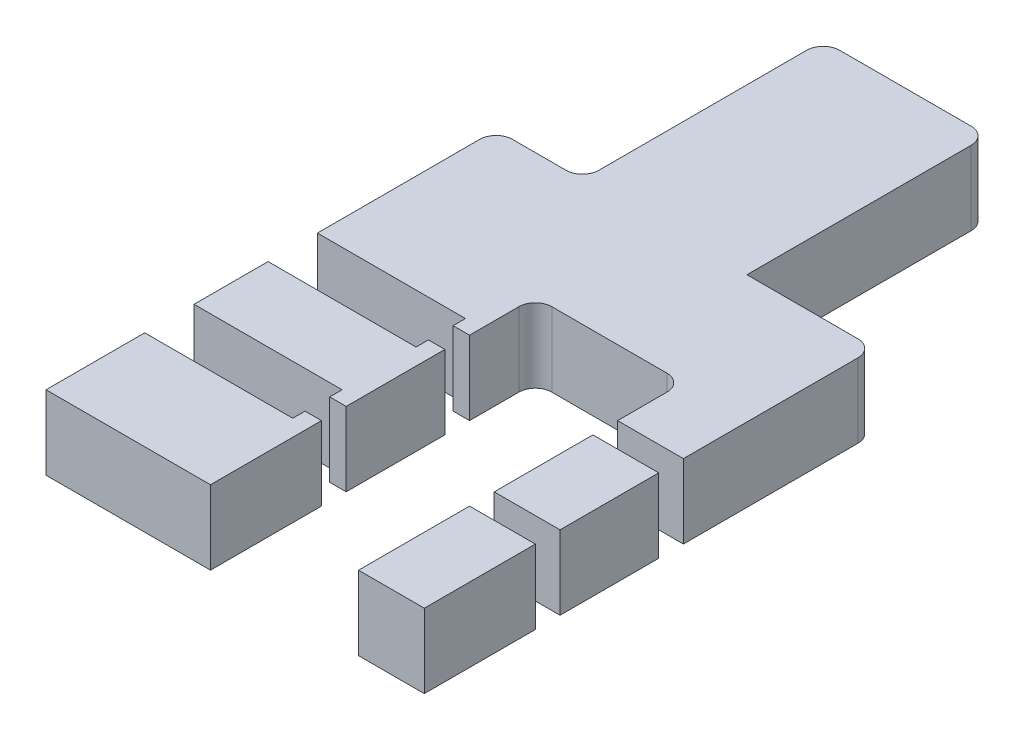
ISO-10303-21;
HEADER;
FILE_DESCRIPTION(('STEP AP214'),'2;1');
FILE_NAME('part.step','',(''),(''),'','','');
FILE_SCHEMA(('AUTOMOTIVE_DESIGN { 1 0 10303 214 1 1 1 1 }'));
ENDSEC;
DATA;
#1=APPLICATION_CONTEXT('core data for automotive mechanical design processes');
#2=APPLICATION_PROTOCOL_DEFINITION('international standard','automotive_design',2000,#1);
#3=PRODUCT_CONTEXT('',#1,'mechanical');
#4=PRODUCT('Part','Part','',(#3));
#5=PRODUCT_RELATED_PRODUCT_CATEGORY('part','',(#4));
#6=PRODUCT_DEFINITION_FORMATION('','',#4);
#7=PRODUCT_DEFINITION_CONTEXT('part definition',#1,'design');
#8=PRODUCT_DEFINITION('design','',#6,#7);
#9=PRODUCT_DEFINITION_SHAPE('','',#8);
#10=(LENGTH_UNIT() NAMED_UNIT(*) SI_UNIT(.MILLI.,.METRE.));
#11=(NAMED_UNIT(*) PLANE_ANGLE_UNIT() SI_UNIT($,.RADIAN.));
#12=(NAMED_UNIT(*) SI_UNIT($,.STERADIAN.) SOLID_ANGLE_UNIT());
#13=UNCERTAINTY_MEASURE_WITH_UNIT(LENGTH_MEASURE(1.E-05),#10,'distance_accuracy_value','');
#14=(GEOMETRIC_REPRESENTATION_CONTEXT(3) GLOBAL_UNCERTAINTY_ASSIGNED_CONTEXT((#13)) GLOBAL_UNIT_ASSIGNED_CONTEXT((#10,
#11,#12)) REPRESENTATION_CONTEXT('',''));
#15=CARTESIAN_POINT('',(0.,0.,0.));
#16=DIRECTION('',(0.,0.,1.));
#17=DIRECTION('',(1.,0.,0.));
#18=AXIS2_PLACEMENT_3D('',#15,#16,#17);
#19=CARTESIAN_POINT('',(17.,9.,39.5));
#20=DIRECTION('',(-1.,0.,0.));
#21=DIRECTION('',(0.,0.,1.));
#22=AXIS2_PLACEMENT_3D('',#19,#20,#21);
#23=PLANE('',#22);
#24=DIRECTION('',(0.,0.,-1.));
#25=VECTOR('',#24,1.);
#26=CARTESIAN_POINT('',(17.,0.,39.5));
#27=LINE('',#26,#25);
#28=CARTESIAN_POINT('',(17.,0.,39.5));
#29=VERTEX_POINT('',#28);
#30=CARTESIAN_POINT('',(17.,0.,26.));
#31=VERTEX_POINT('',#30);
#32=EDGE_CURVE('E47',#29,#31,#27,.T.);
#33=ORIENTED_EDGE('',*,*,#32,.T.);
#34=DIRECTION('',(0.,1.,0.));
#35=VECTOR('',#34,1.);
#36=CARTESIAN_POINT('',(17.,9.,26.));
#37=LINE('',#36,#35);
#38=CARTESIAN_POINT('',(17.,9.,26.));
#39=VERTEX_POINT('',#38);
#40=EDGE_CURVE('E61',#31,#39,#37,.T.);
#41=ORIENTED_EDGE('',*,*,#40,.T.);
#42=DIRECTION('',(0.,0.,-1.));
#43=VECTOR('',#42,1.);
#44=CARTESIAN_POINT('',(17.,9.,39.5));
#45=LINE('',#44,#43);
#46=CARTESIAN_POINT('',(17.,9.,39.5));
#47=VERTEX_POINT('',#46);
#48=EDGE_CURVE('E98',#47,#39,#45,.T.);
#49=ORIENTED_EDGE('',*,*,#48,.F.);
#50=DIRECTION('',(0.,-1.,0.));
#51=VECTOR('',#50,1.);
#52=CARTESIAN_POINT('',(17.,9.,39.5));
#53=LINE('',#52,#51);
#54=EDGE_CURVE('E93',#47,#29,#53,.T.);
#55=ORIENTED_EDGE('',*,*,#54,.T.);
#56=EDGE_LOOP('',(#33,#41,#49,#55));
#57=FACE_BOUND('',#56,.T.);
#58=ADVANCED_FACE('F44',(#57),#23,.F.);
#59=CARTESIAN_POINT('',(9.,9.,0.));
#60=DIRECTION('',(1.,0.,0.));
#61=DIRECTION('',(0.,0.,-1.));
#62=AXIS2_PLACEMENT_3D('',#59,#60,#61);
#63=PLANE('',#62);
#64=DIRECTION('',(0.,0.,1.));
#65=VECTOR('',#64,1.);
#66=CARTESIAN_POINT('',(9.,9.,0.));
#67=LINE('',#66,#65);
#68=CARTESIAN_POINT('',(9.00000000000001,9.,26.));
#69=VERTEX_POINT('',#68);
#70=CARTESIAN_POINT('',(9.00000000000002,9.,39.5));
#71=VERTEX_POINT('',#70);
#72=EDGE_CURVE('E92',#69,#71,#67,.T.);
#73=ORIENTED_EDGE('',*,*,#72,.F.);
#74=DIRECTION('',(0.,-1.,0.));
#75=VECTOR('',#74,1.);
#76=CARTESIAN_POINT('',(9.00000000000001,9.,26.));
#77=LINE('',#76,#75);
#78=CARTESIAN_POINT('',(9.00000000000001,0.,26.));
#79=VERTEX_POINT('',#78);
#80=EDGE_CURVE('E79',#69,#79,#77,.T.);
#81=ORIENTED_EDGE('',*,*,#80,.T.);
#82=DIRECTION('',(0.,0.,1.));
#83=VECTOR('',#82,1.);
#84=CARTESIAN_POINT('',(9.,0.,0.));
#85=LINE('',#84,#83);
#86=CARTESIAN_POINT('',(9.00000000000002,0.,39.5));
#87=VERTEX_POINT('',#86);
#88=EDGE_CURVE('E90',#79,#87,#85,.T.);
#89=ORIENTED_EDGE('',*,*,#88,.T.);
#90=DIRECTION('',(0.,-1.,0.));
#91=VECTOR('',#90,1.);
#92=CARTESIAN_POINT('',(9.00000000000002,9.,39.5));
#93=LINE('',#92,#91);
#94=EDGE_CURVE('E53',#71,#87,#93,.T.);
#95=ORIENTED_EDGE('',*,*,#94,.F.);
#96=EDGE_LOOP('',(#73,#81,#89,#95));
#97=FACE_BOUND('',#96,.T.);
#98=ADVANCED_FACE('F88',(#97),#63,.F.);
#99=CARTESIAN_POINT('',(0.,9.,0.));
#100=DIRECTION('',(0.,-1.,0.));
#101=DIRECTION('',(0.,0.,-1.));
#102=AXIS2_PLACEMENT_3D('',#99,#100,#101);
#103=PLANE('',#102);
#104=ORIENTED_EDGE('',*,*,#48,.T.);
#105=DIRECTION('',(-1.,0.,0.));
#106=VECTOR('',#105,1.);
#107=CARTESIAN_POINT('',(0.,9.,26.));
#108=LINE('',#107,#106);
#109=EDGE_CURVE('E100',#39,#69,#108,.T.);
#110=ORIENTED_EDGE('',*,*,#109,.T.);
#111=ORIENTED_EDGE('',*,*,#72,.T.);
#112=DIRECTION('',(1.,0.,0.));
#113=VECTOR('',#112,1.);
#114=CARTESIAN_POINT('',(9.00000000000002,9.,39.5));
#115=LINE('',#114,#113);
#116=EDGE_CURVE('E104',#71,#47,#115,.T.);
#117=ORIENTED_EDGE('',*,*,#116,.T.);
#118=EDGE_LOOP('',(#104,#110,#111,#117));
#119=FACE_BOUND('',#118,.T.);
#120=ADVANCED_FACE('F114',(#119),#103,.F.);
#121=CARTESIAN_POINT('',(0.,0.,0.));
#122=DIRECTION('',(0.,-1.,0.));
#123=DIRECTION('',(0.,0.,-1.));
#124=AXIS2_PLACEMENT_3D('',#121,#122,#123);
#125=PLANE('',#124);
#126=DIRECTION('',(-1.,0.,0.));
#127=VECTOR('',#126,1.);
#128=CARTESIAN_POINT('',(0.,0.,26.));
#129=LINE('',#128,#127);
#130=EDGE_CURVE('E12',#31,#79,#129,.T.);
#131=ORIENTED_EDGE('',*,*,#130,.F.);
#132=ORIENTED_EDGE('',*,*,#32,.F.);
#133=DIRECTION('',(1.,0.,0.));
#134=VECTOR('',#133,1.);
#135=CARTESIAN_POINT('',(9.00000000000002,0.,39.5));
#136=LINE('',#135,#134);
#137=EDGE_CURVE('E97',#87,#29,#136,.T.);
#138=ORIENTED_EDGE('',*,*,#137,.F.);
#139=ORIENTED_EDGE('',*,*,#88,.F.);
#140=EDGE_LOOP('',(#131,#132,#138,#139));
#141=FACE_BOUND('',#140,.T.);
#142=ADVANCED_FACE('F96',(#141),#125,.T.);
#143=CARTESIAN_POINT('',(9.00000000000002,9.,39.5));
#144=DIRECTION('',(0.,0.,-1.));
#145=DIRECTION('',(-1.,0.,0.));
#146=AXIS2_PLACEMENT_3D('',#143,#144,#145);
#147=PLANE('',#146);
#148=ORIENTED_EDGE('',*,*,#137,.T.);
#149=ORIENTED_EDGE('',*,*,#54,.F.);
#150=ORIENTED_EDGE('',*,*,#116,.F.);
#151=ORIENTED_EDGE('',*,*,#94,.T.);
#152=EDGE_LOOP('',(#148,#149,#150,#151));
#153=FACE_BOUND('',#152,.T.);
#154=ADVANCED_FACE('F117',(#153),#147,.F.);
#155=CARTESIAN_POINT('',(-50.4890898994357,0.,26.));
#156=DIRECTION('',(0.,0.,1.));
#157=DIRECTION('',(1.,0.,0.));
#158=AXIS2_PLACEMENT_3D('',#155,#156,#157);
#159=PLANE('',#158);
#160=ORIENTED_EDGE('',*,*,#130,.T.);
#161=ORIENTED_EDGE('',*,*,#80,.F.);
#162=ORIENTED_EDGE('',*,*,#109,.F.);
#163=ORIENTED_EDGE('',*,*,#40,.F.);
#164=EDGE_LOOP('',(#160,#161,#162,#163));
#165=FACE_BOUND('',#164,.T.);
#166=ADVANCED_FACE('F81',(#165),#159,.F.);
#167=CLOSED_SHELL('',(#58,#98,#120,#142,#154,#166));
#168=MANIFOLD_SOLID_BREP('B2',#167);
#169=CARTESIAN_POINT('',(0.,9.,0.));
#170=DIRECTION('',(0.,-1.,0.));
#171=DIRECTION('',(0.,0.,-1.));
#172=AXIS2_PLACEMENT_3D('',#169,#170,#171);
#173=PLANE('',#172);
#174=DIRECTION('',(-1.,0.,0.));
#175=VECTOR('',#174,1.);
#176=CARTESIAN_POINT('',(0.,9.,26.));
#177=LINE('',#176,#175);
#178=CARTESIAN_POINT('',(-8.99999999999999,9.,26.));
#179=VERTEX_POINT('',#178);
#180=CARTESIAN_POINT('',(-11.,9.,26.));
#181=VERTEX_POINT('',#180);
#182=EDGE_CURVE('E263',#179,#181,#177,.T.);
#183=ORIENTED_EDGE('',*,*,#182,.T.);
#184=DIRECTION('',(0.,0.,-1.));
#185=VECTOR('',#184,1.);
#186=CARTESIAN_POINT('',(-11.,9.,21.5));
#187=LINE('',#186,#185);
#188=CARTESIAN_POINT('',(-11.,9.,27.5));
#189=VERTEX_POINT('',#188);
#190=EDGE_CURVE('E192',#189,#181,#187,.T.);
#191=ORIENTED_EDGE('',*,*,#190,.F.);
#192=DIRECTION('',(1.,0.,0.));
#193=VECTOR('',#192,1.);
#194=CARTESIAN_POINT('',(-29.,9.,27.5));
#195=LINE('',#194,#193);
#196=CARTESIAN_POINT('',(-29.,9.,27.5));
#197=VERTEX_POINT('',#196);
#198=EDGE_CURVE('E276',#197,#189,#195,.T.);
#199=ORIENTED_EDGE('',*,*,#198,.F.);
#200=DIRECTION('',(0.,0.,1.));
#201=VECTOR('',#200,1.);
#202=CARTESIAN_POINT('',(-29.,9.,39.5));
#203=LINE('',#202,#201);
#204=CARTESIAN_POINT('',(-29.,9.,39.5));
#205=VERTEX_POINT('',#204);
#206=EDGE_CURVE('E247',#197,#205,#203,.T.);
#207=ORIENTED_EDGE('',*,*,#206,.T.);
#208=DIRECTION('',(1.,0.,0.));
#209=VECTOR('',#208,1.);
#210=CARTESIAN_POINT('',(-8.99999999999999,9.,39.5));
#211=LINE('',#210,#209);
#212=CARTESIAN_POINT('',(-8.99999999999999,9.,39.5));
#213=VERTEX_POINT('',#212);
#214=EDGE_CURVE('E262',#205,#213,#211,.T.);
#215=ORIENTED_EDGE('',*,*,#214,.T.);
#216=DIRECTION('',(0.,0.,-1.));
#217=VECTOR('',#216,1.);
#218=CARTESIAN_POINT('',(-9.,9.,0.));
#219=LINE('',#218,#217);
#220=EDGE_CURVE('E264',#213,#179,#219,.T.);
#221=ORIENTED_EDGE('',*,*,#220,.T.);
#222=EDGE_LOOP('',(#183,#191,#199,#207,#215,#221));
#223=FACE_BOUND('',#222,.T.);
#224=ADVANCED_FACE('F178',(#223),#173,.F.);
#225=CARTESIAN_POINT('',(0.,0.,0.));
#226=DIRECTION('',(0.,-1.,0.));
#227=DIRECTION('',(0.,0.,-1.));
#228=AXIS2_PLACEMENT_3D('',#225,#226,#227);
#229=PLANE('',#228);
#230=DIRECTION('',(0.,0.,-1.));
#231=VECTOR('',#230,1.);
#232=CARTESIAN_POINT('',(-11.,0.,21.5));
#233=LINE('',#232,#231);
#234=CARTESIAN_POINT('',(-11.,0.,27.5));
#235=VERTEX_POINT('',#234);
#236=CARTESIAN_POINT('',(-11.,0.,26.));
#237=VERTEX_POINT('',#236);
#238=EDGE_CURVE('E239',#235,#237,#233,.T.);
#239=ORIENTED_EDGE('',*,*,#238,.T.);
#240=DIRECTION('',(1.,0.,0.));
#241=VECTOR('',#240,1.);
#242=CARTESIAN_POINT('',(-50.4890898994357,0.,26.));
#243=LINE('',#242,#241);
#244=CARTESIAN_POINT('',(-9.,0.,26.));
#245=VERTEX_POINT('',#244);
#246=EDGE_CURVE('E199',#237,#245,#243,.T.);
#247=ORIENTED_EDGE('',*,*,#246,.T.);
#248=DIRECTION('',(0.,0.,-1.));
#249=VECTOR('',#248,1.);
#250=CARTESIAN_POINT('',(-9.,0.,0.));
#251=LINE('',#250,#249);
#252=CARTESIAN_POINT('',(-8.99999999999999,0.,39.5));
#253=VERTEX_POINT('',#252);
#254=EDGE_CURVE('E258',#253,#245,#251,.T.);
#255=ORIENTED_EDGE('',*,*,#254,.F.);
#256=DIRECTION('',(1.,0.,0.));
#257=VECTOR('',#256,1.);
#258=CARTESIAN_POINT('',(-8.99999999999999,0.,39.5));
#259=LINE('',#258,#257);
#260=CARTESIAN_POINT('',(-29.,0.,39.5));
#261=VERTEX_POINT('',#260);
#262=EDGE_CURVE('E251',#261,#253,#259,.T.);
#263=ORIENTED_EDGE('',*,*,#262,.F.);
#264=DIRECTION('',(0.,0.,1.));
#265=VECTOR('',#264,1.);
#266=CARTESIAN_POINT('',(-29.,0.,39.5));
#267=LINE('',#266,#265);
#268=CARTESIAN_POINT('',(-29.,0.,27.5));
#269=VERTEX_POINT('',#268);
#270=EDGE_CURVE('E245',#269,#261,#267,.T.);
#271=ORIENTED_EDGE('',*,*,#270,.F.);
#272=DIRECTION('',(1.,0.,0.));
#273=VECTOR('',#272,1.);
#274=CARTESIAN_POINT('',(-29.,0.,27.5));
#275=LINE('',#274,#273);
#276=EDGE_CURVE('E230',#269,#235,#275,.T.);
#277=ORIENTED_EDGE('',*,*,#276,.T.);
#278=EDGE_LOOP('',(#239,#247,#255,#263,#271,#277));
#279=FACE_BOUND('',#278,.T.);
#280=ADVANCED_FACE('F250',(#279),#229,.T.);
#281=CARTESIAN_POINT('',(-9.,9.,0.));
#282=DIRECTION('',(-1.,0.,0.));
#283=DIRECTION('',(0.,0.,1.));
#284=AXIS2_PLACEMENT_3D('',#281,#282,#283);
#285=PLANE('',#284);
#286=ORIENTED_EDGE('',*,*,#254,.T.);
#287=DIRECTION('',(0.,1.,0.));
#288=VECTOR('',#287,1.);
#289=CARTESIAN_POINT('',(-9.,9.,26.));
#290=LINE('',#289,#288);
#291=EDGE_CURVE('E255',#245,#179,#290,.T.);
#292=ORIENTED_EDGE('',*,*,#291,.T.);
#293=ORIENTED_EDGE('',*,*,#220,.F.);
#294=DIRECTION('',(0.,-1.,0.));
#295=VECTOR('',#294,1.);
#296=CARTESIAN_POINT('',(-8.99999999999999,9.,39.5));
#297=LINE('',#296,#295);
#298=EDGE_CURVE('E252',#213,#253,#297,.T.);
#299=ORIENTED_EDGE('',*,*,#298,.T.);
#300=EDGE_LOOP('',(#286,#292,#293,#299));
#301=FACE_BOUND('',#300,.T.);
#302=ADVANCED_FACE('F282',(#301),#285,.F.);
#303=CARTESIAN_POINT('',(-29.,9.,39.5));
#304=DIRECTION('',(1.,0.,0.));
#305=DIRECTION('',(0.,0.,-1.));
#306=AXIS2_PLACEMENT_3D('',#303,#304,#305);
#307=PLANE('',#306);
#308=ORIENTED_EDGE('',*,*,#206,.F.);
#309=DIRECTION('',(0.,1.,0.));
#310=VECTOR('',#309,1.);
#311=CARTESIAN_POINT('',(-29.,0.,27.5));
#312=LINE('',#311,#310);
#313=EDGE_CURVE('E234',#269,#197,#312,.T.);
#314=ORIENTED_EDGE('',*,*,#313,.F.);
#315=ORIENTED_EDGE('',*,*,#270,.T.);
#316=DIRECTION('',(0.,-1.,0.));
#317=VECTOR('',#316,1.);
#318=CARTESIAN_POINT('',(-29.,9.,39.5));
#319=LINE('',#318,#317);
#320=EDGE_CURVE('E185',#205,#261,#319,.T.);
#321=ORIENTED_EDGE('',*,*,#320,.F.);
#322=EDGE_LOOP('',(#308,#314,#315,#321));
#323=FACE_BOUND('',#322,.T.);
#324=ADVANCED_FACE('F243',(#323),#307,.F.);
#325=CARTESIAN_POINT('',(-8.99999999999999,9.,39.5));
#326=DIRECTION('',(0.,0.,-1.));
#327=DIRECTION('',(-1.,0.,0.));
#328=AXIS2_PLACEMENT_3D('',#325,#326,#327);
#329=PLANE('',#328);
#330=ORIENTED_EDGE('',*,*,#262,.T.);
#331=ORIENTED_EDGE('',*,*,#298,.F.);
#332=ORIENTED_EDGE('',*,*,#214,.F.);
#333=ORIENTED_EDGE('',*,*,#320,.T.);
#334=EDGE_LOOP('',(#330,#331,#332,#333));
#335=FACE_BOUND('',#334,.T.);
#336=ADVANCED_FACE('F286',(#335),#329,.F.);
#337=CARTESIAN_POINT('',(-50.4890898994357,0.,26.));
#338=DIRECTION('',(0.,0.,1.));
#339=DIRECTION('',(1.,0.,0.));
#340=AXIS2_PLACEMENT_3D('',#337,#338,#339);
#341=PLANE('',#340);
#342=ORIENTED_EDGE('',*,*,#246,.F.);
#343=DIRECTION('',(0.,1.,0.));
#344=VECTOR('',#343,1.);
#345=CARTESIAN_POINT('',(-11.,0.,26.));
#346=LINE('',#345,#344);
#347=EDGE_CURVE('E42',#237,#181,#346,.T.);
#348=ORIENTED_EDGE('',*,*,#347,.T.);
#349=ORIENTED_EDGE('',*,*,#182,.F.);
#350=ORIENTED_EDGE('',*,*,#291,.F.);
#351=EDGE_LOOP('',(#342,#348,#349,#350));
#352=FACE_BOUND('',#351,.T.);
#353=ADVANCED_FACE('F279',(#352),#341,.F.);
#354=CARTESIAN_POINT('',(-11.,0.,21.5));
#355=DIRECTION('',(1.,0.,0.));
#356=DIRECTION('',(0.,0.,-1.));
#357=AXIS2_PLACEMENT_3D('',#354,#355,#356);
#358=PLANE('',#357);
#359=ORIENTED_EDGE('',*,*,#238,.F.);
#360=DIRECTION('',(0.,1.,0.));
#361=VECTOR('',#360,1.);
#362=CARTESIAN_POINT('',(-11.,0.,27.5));
#363=LINE('',#362,#361);
#364=EDGE_CURVE('E236',#235,#189,#363,.T.);
#365=ORIENTED_EDGE('',*,*,#364,.T.);
#366=ORIENTED_EDGE('',*,*,#190,.T.);
#367=ORIENTED_EDGE('',*,*,#347,.F.);
#368=EDGE_LOOP('',(#359,#365,#366,#367));
#369=FACE_BOUND('',#368,.T.);
#370=ADVANCED_FACE('F301',(#369),#358,.F.);
#371=CARTESIAN_POINT('',(-29.,0.,27.5));
#372=DIRECTION('',(0.,0.,1.));
#373=DIRECTION('',(1.,0.,0.));
#374=AXIS2_PLACEMENT_3D('',#371,#372,#373);
#375=PLANE('',#374);
#376=ORIENTED_EDGE('',*,*,#198,.T.);
#377=ORIENTED_EDGE('',*,*,#364,.F.);
#378=ORIENTED_EDGE('',*,*,#276,.F.);
#379=ORIENTED_EDGE('',*,*,#313,.T.);
#380=EDGE_LOOP('',(#376,#377,#378,#379));
#381=FACE_BOUND('',#380,.T.);
#382=ADVANCED_FACE('F233',(#381),#375,.F.);
#383=CLOSED_SHELL('',(#224,#280,#302,#324,#336,#353,#370,#382));
#384=MANIFOLD_SOLID_BREP('B6',#383);
#385=CARTESIAN_POINT('',(-47.5605721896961,0.,11.));
#386=DIRECTION('',(0.,0.,1.));
#387=DIRECTION('',(1.,0.,0.));
#388=AXIS2_PLACEMENT_3D('',#385,#386,#387);
#389=PLANE('',#388);
#390=DIRECTION('',(-1.,0.,0.));
#391=VECTOR('',#390,1.);
#392=CARTESIAN_POINT('',(0.,0.,11.));
#393=LINE('',#392,#391);
#394=CARTESIAN_POINT('',(17.,0.,11.));
#395=VERTEX_POINT('',#394);
#396=CARTESIAN_POINT('',(9.00000000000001,0.,11.));
#397=VERTEX_POINT('',#396);
#398=EDGE_CURVE('E372',#395,#397,#393,.T.);
#399=ORIENTED_EDGE('',*,*,#398,.T.);
#400=DIRECTION('',(0.,-1.,0.));
#401=VECTOR('',#400,1.);
#402=CARTESIAN_POINT('',(9.00000000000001,9.,11.));
#403=LINE('',#402,#401);
#404=CARTESIAN_POINT('',(9.00000000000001,9.,11.));
#405=VERTEX_POINT('',#404);
#406=EDGE_CURVE('E419',#405,#397,#403,.T.);
#407=ORIENTED_EDGE('',*,*,#406,.F.);
#408=DIRECTION('',(-1.,0.,0.));
#409=VECTOR('',#408,1.);
#410=CARTESIAN_POINT('',(0.,9.,11.));
#411=LINE('',#410,#409);
#412=CARTESIAN_POINT('',(17.,9.,11.));
#413=VERTEX_POINT('',#412);
#414=EDGE_CURVE('E423',#413,#405,#411,.T.);
#415=ORIENTED_EDGE('',*,*,#414,.F.);
#416=DIRECTION('',(0.,1.,0.));
#417=VECTOR('',#416,1.);
#418=CARTESIAN_POINT('',(17.,9.,11.));
#419=LINE('',#418,#417);
#420=EDGE_CURVE('E417',#395,#413,#419,.T.);
#421=ORIENTED_EDGE('',*,*,#420,.F.);
#422=EDGE_LOOP('',(#399,#407,#415,#421));
#423=FACE_BOUND('',#422,.T.);
#424=ADVANCED_FACE('F364',(#423),#389,.F.);
#425=CARTESIAN_POINT('',(0.,9.,0.));
#426=DIRECTION('',(0.,-1.,0.));
#427=DIRECTION('',(0.,0.,-1.));
#428=AXIS2_PLACEMENT_3D('',#425,#426,#427);
#429=PLANE('',#428);
#430=DIRECTION('',(0.,0.,1.));
#431=VECTOR('',#430,1.);
#432=CARTESIAN_POINT('',(9.,9.,0.));
#433=LINE('',#432,#431);
#434=CARTESIAN_POINT('',(9.00000000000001,9.,23.));
#435=VERTEX_POINT('',#434);
#436=EDGE_CURVE('E427',#405,#435,#433,.T.);
#437=ORIENTED_EDGE('',*,*,#436,.T.);
#438=DIRECTION('',(1.,0.,0.));
#439=VECTOR('',#438,1.);
#440=CARTESIAN_POINT('',(0.,9.,23.));
#441=LINE('',#440,#439);
#442=CARTESIAN_POINT('',(17.,9.,23.));
#443=VERTEX_POINT('',#442);
#444=EDGE_CURVE('E407',#435,#443,#441,.T.);
#445=ORIENTED_EDGE('',*,*,#444,.T.);
#446=DIRECTION('',(0.,0.,-1.));
#447=VECTOR('',#446,1.);
#448=CARTESIAN_POINT('',(17.,9.,39.5));
#449=LINE('',#448,#447);
#450=EDGE_CURVE('E414',#443,#413,#449,.T.);
#451=ORIENTED_EDGE('',*,*,#450,.T.);
#452=ORIENTED_EDGE('',*,*,#414,.T.);
#453=EDGE_LOOP('',(#437,#445,#451,#452));
#454=FACE_BOUND('',#453,.T.);
#455=ADVANCED_FACE('F433',(#454),#429,.F.);
#456=CARTESIAN_POINT('',(0.,0.,0.));
#457=DIRECTION('',(0.,-1.,0.));
#458=DIRECTION('',(0.,0.,-1.));
#459=AXIS2_PLACEMENT_3D('',#456,#457,#458);
#460=PLANE('',#459);
#461=DIRECTION('',(1.,0.,0.));
#462=VECTOR('',#461,1.);
#463=CARTESIAN_POINT('',(0.,0.,23.));
#464=LINE('',#463,#462);
#465=CARTESIAN_POINT('',(9.00000000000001,0.,23.));
#466=VERTEX_POINT('',#465);
#467=CARTESIAN_POINT('',(17.,0.,23.));
#468=VERTEX_POINT('',#467);
#469=EDGE_CURVE('E176',#466,#468,#464,.T.);
#470=ORIENTED_EDGE('',*,*,#469,.F.);
#471=DIRECTION('',(0.,0.,1.));
#472=VECTOR('',#471,1.);
#473=CARTESIAN_POINT('',(9.,0.,0.));
#474=LINE('',#473,#472);
#475=EDGE_CURVE('E425',#397,#466,#474,.T.);
#476=ORIENTED_EDGE('',*,*,#475,.F.);
#477=ORIENTED_EDGE('',*,*,#398,.F.);
#478=DIRECTION('',(0.,0.,-1.));
#479=VECTOR('',#478,1.);
#480=CARTESIAN_POINT('',(17.,0.,39.5));
#481=LINE('',#480,#479);
#482=EDGE_CURVE('E387',#468,#395,#481,.T.);
#483=ORIENTED_EDGE('',*,*,#482,.F.);
#484=EDGE_LOOP('',(#470,#476,#477,#483));
#485=FACE_BOUND('',#484,.T.);
#486=ADVANCED_FACE('F416',(#485),#460,.T.);
#487=CARTESIAN_POINT('',(9.,9.,0.));
#488=DIRECTION('',(1.,0.,0.));
#489=DIRECTION('',(0.,0.,-1.));
#490=AXIS2_PLACEMENT_3D('',#487,#488,#489);
#491=PLANE('',#490);
#492=ORIENTED_EDGE('',*,*,#475,.T.);
#493=DIRECTION('',(0.,1.,0.));
#494=VECTOR('',#493,1.);
#495=CARTESIAN_POINT('',(9.00000000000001,9.,23.));
#496=LINE('',#495,#494);
#497=EDGE_CURVE('E378',#466,#435,#496,.T.);
#498=ORIENTED_EDGE('',*,*,#497,.T.);
#499=ORIENTED_EDGE('',*,*,#436,.F.);
#500=ORIENTED_EDGE('',*,*,#406,.T.);
#501=EDGE_LOOP('',(#492,#498,#499,#500));
#502=FACE_BOUND('',#501,.T.);
#503=ADVANCED_FACE('F435',(#502),#491,.F.);
#504=CARTESIAN_POINT('',(17.,9.,39.5));
#505=DIRECTION('',(-1.,0.,0.));
#506=DIRECTION('',(0.,0.,1.));
#507=AXIS2_PLACEMENT_3D('',#504,#505,#506);
#508=PLANE('',#507);
#509=ORIENTED_EDGE('',*,*,#450,.F.);
#510=DIRECTION('',(0.,-1.,0.));
#511=VECTOR('',#510,1.);
#512=CARTESIAN_POINT('',(17.,9.,23.));
#513=LINE('',#512,#511);
#514=EDGE_CURVE('E404',#443,#468,#513,.T.);
#515=ORIENTED_EDGE('',*,*,#514,.T.);
#516=ORIENTED_EDGE('',*,*,#482,.T.);
#517=ORIENTED_EDGE('',*,*,#420,.T.);
#518=EDGE_LOOP('',(#509,#515,#516,#517));
#519=FACE_BOUND('',#518,.T.);
#520=ADVANCED_FACE('F366',(#519),#508,.F.);
#521=CARTESIAN_POINT('',(-50.4890898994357,0.,23.));
#522=DIRECTION('',(0.,0.,-1.));
#523=DIRECTION('',(-1.,0.,0.));
#524=AXIS2_PLACEMENT_3D('',#521,#522,#523);
#525=PLANE('',#524);
#526=ORIENTED_EDGE('',*,*,#444,.F.);
#527=ORIENTED_EDGE('',*,*,#497,.F.);
#528=ORIENTED_EDGE('',*,*,#469,.T.);
#529=ORIENTED_EDGE('',*,*,#514,.F.);
#530=EDGE_LOOP('',(#526,#527,#528,#529));
#531=FACE_BOUND('',#530,.T.);
#532=ADVANCED_FACE('F409',(#531),#525,.F.);
#533=CLOSED_SHELL('',(#424,#455,#486,#503,#520,#532));
#534=MANIFOLD_SOLID_BREP('B36',#533);
#535=CARTESIAN_POINT('',(-7.,9.,2.));
#536=DIRECTION('',(0.,1.,0.));
#537=DIRECTION('',(0.,0.,1.));
#538=AXIS2_PLACEMENT_3D('',#535,#536,#537);
#539=CYLINDRICAL_SURFACE('',#538,2.);
#540=CARTESIAN_POINT('',(-7.,9.,2.));
#541=DIRECTION('',(0.,-1.,0.));
#542=DIRECTION('',(0.,0.,-1.));
#543=AXIS2_PLACEMENT_3D('',#540,#541,#542);
#544=CIRCLE('',#543,2.);
#545=CARTESIAN_POINT('',(-9.,9.,2.));
#546=VERTEX_POINT('',#545);
#547=CARTESIAN_POINT('',(-7.,9.,0.));
#548=VERTEX_POINT('',#547);
#549=EDGE_CURVE('E676',#546,#548,#544,.T.);
#550=ORIENTED_EDGE('',*,*,#549,.F.);
#551=DIRECTION('',(0.,-1.,0.));
#552=VECTOR('',#551,1.);
#553=CARTESIAN_POINT('',(-9.,9.,2.));
#554=LINE('',#553,#552);
#555=CARTESIAN_POINT('',(-9.,0.,2.));
#556=VERTEX_POINT('',#555);
#557=EDGE_CURVE('E716',#556,#546,#554,.F.);
#558=ORIENTED_EDGE('',*,*,#557,.F.);
#559=CARTESIAN_POINT('',(-7.,0.,2.));
#560=DIRECTION('',(0.,-1.,0.));
#561=DIRECTION('',(0.,0.,-1.));
#562=AXIS2_PLACEMENT_3D('',#559,#560,#561);
#563=CIRCLE('',#562,2.);
#564=CARTESIAN_POINT('',(-7.,0.,0.));
#565=VERTEX_POINT('',#564);
#566=EDGE_CURVE('E745',#565,#556,#563,.F.);
#567=ORIENTED_EDGE('',*,*,#566,.F.);
#568=DIRECTION('',(0.,-1.,0.));
#569=VECTOR('',#568,1.);
#570=CARTESIAN_POINT('',(-7.,0.,0.));
#571=LINE('',#570,#569);
#572=EDGE_CURVE('E839',#548,#565,#571,.T.);
#573=ORIENTED_EDGE('',*,*,#572,.F.);
#574=EDGE_LOOP('',(#550,#558,#567,#573));
#575=FACE_BOUND('',#574,.T.);
#576=ADVANCED_FACE('F497',(#575),#539,.F.);
#577=CARTESIAN_POINT('',(-9.,9.,0.));
#578=DIRECTION('',(0.,0.,-1.));
#579=DIRECTION('',(-1.,0.,0.));
#580=AXIS2_PLACEMENT_3D('',#577,#578,#579);
#581=PLANE('',#580);
#582=DIRECTION('',(1.,0.,0.));
#583=VECTOR('',#582,1.);
#584=CARTESIAN_POINT('',(-9.,0.,0.));
#585=LINE('',#584,#583);
#586=CARTESIAN_POINT('',(7.,0.,0.));
#587=VERTEX_POINT('',#586);
#588=EDGE_CURVE('E746',#565,#587,#585,.T.);
#589=ORIENTED_EDGE('',*,*,#588,.T.);
#590=DIRECTION('',(0.,-1.,0.));
#591=VECTOR('',#590,1.);
#592=CARTESIAN_POINT('',(7.,9.,0.));
#593=LINE('',#592,#591);
#594=CARTESIAN_POINT('',(7.,9.,0.));
#595=VERTEX_POINT('',#594);
#596=EDGE_CURVE('E749',#587,#595,#593,.F.);
#597=ORIENTED_EDGE('',*,*,#596,.T.);
#598=DIRECTION('',(1.,0.,0.));
#599=VECTOR('',#598,1.);
#600=CARTESIAN_POINT('',(-9.,9.,0.));
#601=LINE('',#600,#599);
#602=EDGE_CURVE('E673',#548,#595,#601,.T.);
#603=ORIENTED_EDGE('',*,*,#602,.F.);
#604=ORIENTED_EDGE('',*,*,#572,.T.);
#605=EDGE_LOOP('',(#589,#597,#603,#604));
#606=FACE_BOUND('',#605,.T.);
#607=ADVANCED_FACE('F790',(#606),#581,.F.);
#608=CARTESIAN_POINT('',(7.,9.,2.));
#609=DIRECTION('',(0.,1.,0.));
#610=DIRECTION('',(0.,0.,1.));
#611=AXIS2_PLACEMENT_3D('',#608,#609,#610);
#612=CYLINDRICAL_SURFACE('',#611,2.);
#613=CARTESIAN_POINT('',(7.,9.,2.));
#614=DIRECTION('',(0.,-1.,0.));
#615=DIRECTION('',(0.,0.,-1.));
#616=AXIS2_PLACEMENT_3D('',#613,#614,#615);
#617=CIRCLE('',#616,2.);
#618=CARTESIAN_POINT('',(9.,9.,2.));
#619=VERTEX_POINT('',#618);
#620=EDGE_CURVE('E672',#595,#619,#617,.T.);
#621=ORIENTED_EDGE('',*,*,#620,.F.);
#622=ORIENTED_EDGE('',*,*,#596,.F.);
#623=CARTESIAN_POINT('',(7.,0.,2.));
#624=DIRECTION('',(0.,-1.,0.));
#625=DIRECTION('',(0.,0.,-1.));
#626=AXIS2_PLACEMENT_3D('',#623,#624,#625);
#627=CIRCLE('',#626,2.);
#628=CARTESIAN_POINT('',(9.,0.,2.));
#629=VERTEX_POINT('',#628);
#630=EDGE_CURVE('E736',#629,#587,#627,.F.);
#631=ORIENTED_EDGE('',*,*,#630,.F.);
#632=DIRECTION('',(0.,-1.,0.));
#633=VECTOR('',#632,1.);
#634=CARTESIAN_POINT('',(9.,0.,2.));
#635=LINE('',#634,#633);
#636=EDGE_CURVE('E699',#619,#629,#635,.T.);
#637=ORIENTED_EDGE('',*,*,#636,.F.);
#638=EDGE_LOOP('',(#621,#622,#631,#637));
#639=FACE_BOUND('',#638,.T.);
#640=ADVANCED_FACE('F796',(#639),#612,.F.);
#641=CARTESIAN_POINT('',(15.,9.,-13.2275954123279));
#642=DIRECTION('',(0.,-1.,0.));
#643=DIRECTION('',(0.,0.,-1.));
#644=AXIS2_PLACEMENT_3D('',#641,#642,#643);
#645=CYLINDRICAL_SURFACE('',#644,2.);
#646=CARTESIAN_POINT('',(15.,9.,-13.2275954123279));
#647=DIRECTION('',(0.,-1.,0.));
#648=DIRECTION('',(0.,0.,-1.));
#649=AXIS2_PLACEMENT_3D('',#646,#647,#648);
#650=CIRCLE('',#649,2.);
#651=CARTESIAN_POINT('',(17.,9.,-13.2275954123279));
#652=VERTEX_POINT('',#651);
#653=CARTESIAN_POINT('',(15.,9.,-15.2275954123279));
#654=VERTEX_POINT('',#653);
#655=EDGE_CURVE('E694',#652,#654,#650,.F.);
#656=ORIENTED_EDGE('',*,*,#655,.F.);
#657=DIRECTION('',(0.,-1.,0.));
#658=VECTOR('',#657,1.);
#659=CARTESIAN_POINT('',(17.,9.,-13.2275954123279));
#660=LINE('',#659,#658);
#661=CARTESIAN_POINT('',(17.,0.,-13.2275954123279));
#662=VERTEX_POINT('',#661);
#663=EDGE_CURVE('E720',#662,#652,#660,.F.);
#664=ORIENTED_EDGE('',*,*,#663,.F.);
#665=CARTESIAN_POINT('',(15.,0.,-13.2275954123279));
#666=DIRECTION('',(0.,-1.,0.));
#667=DIRECTION('',(0.,0.,-1.));
#668=AXIS2_PLACEMENT_3D('',#665,#666,#667);
#669=CIRCLE('',#668,2.);
#670=CARTESIAN_POINT('',(15.,0.,-15.2275954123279));
#671=VERTEX_POINT('',#670);
#672=EDGE_CURVE('E731',#671,#662,#669,.T.);
#673=ORIENTED_EDGE('',*,*,#672,.F.);
#674=DIRECTION('',(0.,-1.,0.));
#675=VECTOR('',#674,1.);
#676=CARTESIAN_POINT('',(15.,9.,-15.2275954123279));
#677=LINE('',#676,#675);
#678=EDGE_CURVE('E643',#654,#671,#677,.T.);
#679=ORIENTED_EDGE('',*,*,#678,.F.);
#680=EDGE_LOOP('',(#656,#664,#673,#679));
#681=FACE_BOUND('',#680,.T.);
#682=ADVANCED_FACE('F806',(#681),#645,.T.);
#683=CARTESIAN_POINT('',(1.5,9.,-15.2275954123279));
#684=DIRECTION('',(0.,0.,1.));
#685=DIRECTION('',(1.,0.,0.));
#686=AXIS2_PLACEMENT_3D('',#683,#684,#685);
#687=PLANE('',#686);
#688=DIRECTION('',(-1.,0.,0.));
#689=VECTOR('',#688,1.);
#690=CARTESIAN_POINT('',(1.5,9.,-15.2275954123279));
#691=LINE('',#690,#689);
#692=CARTESIAN_POINT('',(1.5,9.,-15.2275954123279));
#693=VERTEX_POINT('',#692);
#694=EDGE_CURVE('E691',#654,#693,#691,.T.);
#695=ORIENTED_EDGE('',*,*,#694,.F.);
#696=ORIENTED_EDGE('',*,*,#678,.T.);
#697=DIRECTION('',(-1.,0.,0.));
#698=VECTOR('',#697,1.);
#699=CARTESIAN_POINT('',(1.5,0.,-15.2275954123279));
#700=LINE('',#699,#698);
#701=CARTESIAN_POINT('',(1.5,0.,-15.2275954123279));
#702=VERTEX_POINT('',#701);
#703=EDGE_CURVE('E636',#671,#702,#700,.T.);
#704=ORIENTED_EDGE('',*,*,#703,.T.);
#705=DIRECTION('',(0.,-1.,0.));
#706=VECTOR('',#705,1.);
#707=CARTESIAN_POINT('',(1.5,9.,-15.2275954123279));
#708=LINE('',#707,#706);
#709=EDGE_CURVE('E640',#693,#702,#708,.T.);
#710=ORIENTED_EDGE('',*,*,#709,.F.);
#711=EDGE_LOOP('',(#695,#696,#704,#710));
#712=FACE_BOUND('',#711,.T.);
#713=ADVANCED_FACE('F639',(#712),#687,.F.);
#714=CARTESIAN_POINT('',(1.49999999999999,9.,-44.5));
#715=DIRECTION('',(-1.,0.,0.));
#716=DIRECTION('',(0.,0.,1.));
#717=AXIS2_PLACEMENT_3D('',#714,#715,#716);
#718=PLANE('',#717);
#719=DIRECTION('',(0.,0.,-1.));
#720=VECTOR('',#719,1.);
#721=CARTESIAN_POINT('',(1.49999999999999,0.,-44.5));
#722=LINE('',#721,#720);
#723=CARTESIAN_POINT('',(1.49999999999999,0.,-42.5));
#724=VERTEX_POINT('',#723);
#725=EDGE_CURVE('E647',#702,#724,#722,.T.);
#726=ORIENTED_EDGE('',*,*,#725,.T.);
#727=DIRECTION('',(0.,-1.,0.));
#728=VECTOR('',#727,1.);
#729=CARTESIAN_POINT('',(1.49999999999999,9.,-42.5));
#730=LINE('',#729,#728);
#731=CARTESIAN_POINT('',(1.49999999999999,9.,-42.5));
#732=VERTEX_POINT('',#731);
#733=EDGE_CURVE('E656',#724,#732,#730,.F.);
#734=ORIENTED_EDGE('',*,*,#733,.T.);
#735=DIRECTION('',(0.,0.,-1.));
#736=VECTOR('',#735,1.);
#737=CARTESIAN_POINT('',(1.49999999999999,9.,-44.5));
#738=LINE('',#737,#736);
#739=EDGE_CURVE('E654',#693,#732,#738,.T.);
#740=ORIENTED_EDGE('',*,*,#739,.F.);
#741=ORIENTED_EDGE('',*,*,#709,.T.);
#742=EDGE_LOOP('',(#726,#734,#740,#741));
#743=FACE_BOUND('',#742,.T.);
#744=ADVANCED_FACE('F651',(#743),#718,.F.);
#745=CARTESIAN_POINT('',(-0.500000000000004,9.,-42.5));
#746=DIRECTION('',(0.,-1.,0.));
#747=DIRECTION('',(0.,0.,-1.));
#748=AXIS2_PLACEMENT_3D('',#745,#746,#747);
#749=CYLINDRICAL_SURFACE('',#748,2.);
#750=CARTESIAN_POINT('',(-0.500000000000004,9.,-42.5));
#751=DIRECTION('',(0.,-1.,0.));
#752=DIRECTION('',(0.,0.,-1.));
#753=AXIS2_PLACEMENT_3D('',#750,#751,#752);
#754=CIRCLE('',#753,2.);
#755=CARTESIAN_POINT('',(-0.500000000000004,9.,-44.5));
#756=VERTEX_POINT('',#755);
#757=EDGE_CURVE('E689',#732,#756,#754,.F.);
#758=ORIENTED_EDGE('',*,*,#757,.F.);
#759=ORIENTED_EDGE('',*,*,#733,.F.);
#760=CARTESIAN_POINT('',(-0.500000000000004,0.,-42.5));
#761=DIRECTION('',(0.,-1.,0.));
#762=DIRECTION('',(0.,0.,-1.));
#763=AXIS2_PLACEMENT_3D('',#760,#761,#762);
#764=CIRCLE('',#763,2.);
#765=CARTESIAN_POINT('',(-0.500000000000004,0.,-44.5));
#766=VERTEX_POINT('',#765);
#767=EDGE_CURVE('E661',#766,#724,#764,.T.);
#768=ORIENTED_EDGE('',*,*,#767,.F.);
#769=DIRECTION('',(0.,-1.,0.));
#770=VECTOR('',#769,1.);
#771=CARTESIAN_POINT('',(-0.500000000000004,9.,-44.5));
#772=LINE('',#771,#770);
#773=EDGE_CURVE('E655',#756,#766,#772,.T.);
#774=ORIENTED_EDGE('',*,*,#773,.F.);
#775=EDGE_LOOP('',(#758,#759,#768,#774));
#776=FACE_BOUND('',#775,.T.);
#777=ADVANCED_FACE('F777',(#776),#749,.T.);
#778=CARTESIAN_POINT('',(-18.5,9.,-44.5));
#779=DIRECTION('',(0.,0.,1.));
#780=DIRECTION('',(1.,0.,0.));
#781=AXIS2_PLACEMENT_3D('',#778,#779,#780);
#782=PLANE('',#781);
#783=DIRECTION('',(-1.,0.,0.));
#784=VECTOR('',#783,1.);
#785=CARTESIAN_POINT('',(-18.5,9.,-44.5));
#786=LINE('',#785,#784);
#787=CARTESIAN_POINT('',(-16.5,9.,-44.5));
#788=VERTEX_POINT('',#787);
#789=EDGE_CURVE('E686',#756,#788,#786,.T.);
#790=ORIENTED_EDGE('',*,*,#789,.F.);
#791=ORIENTED_EDGE('',*,*,#773,.T.);
#792=DIRECTION('',(-1.,0.,0.));
#793=VECTOR('',#792,1.);
#794=CARTESIAN_POINT('',(-18.5,0.,-44.5));
#795=LINE('',#794,#793);
#796=CARTESIAN_POINT('',(-16.5,0.,-44.5));
#797=VERTEX_POINT('',#796);
#798=EDGE_CURVE('E665',#766,#797,#795,.T.);
#799=ORIENTED_EDGE('',*,*,#798,.T.);
#800=DIRECTION('',(0.,-1.,0.));
#801=VECTOR('',#800,1.);
#802=CARTESIAN_POINT('',(-16.5,9.,-44.5));
#803=LINE('',#802,#801);
#804=EDGE_CURVE('E740',#797,#788,#803,.F.);
#805=ORIENTED_EDGE('',*,*,#804,.T.);
#806=EDGE_LOOP('',(#790,#791,#799,#805));
#807=FACE_BOUND('',#806,.T.);
#808=ADVANCED_FACE('F774',(#807),#782,.F.);
#809=CARTESIAN_POINT('',(-16.5,9.,-42.5));
#810=DIRECTION('',(0.,-1.,0.));
#811=DIRECTION('',(0.,0.,-1.));
#812=AXIS2_PLACEMENT_3D('',#809,#810,#811);
#813=CYLINDRICAL_SURFACE('',#812,2.);
#814=CARTESIAN_POINT('',(-16.5,9.,-42.5));
#815=DIRECTION('',(0.,-1.,0.));
#816=DIRECTION('',(0.,0.,-1.));
#817=AXIS2_PLACEMENT_3D('',#814,#815,#816);
#818=CIRCLE('',#817,2.);
#819=CARTESIAN_POINT('',(-18.5,9.,-42.5));
#820=VERTEX_POINT('',#819);
#821=EDGE_CURVE('E685',#788,#820,#818,.F.);
#822=ORIENTED_EDGE('',*,*,#821,.F.);
#823=ORIENTED_EDGE('',*,*,#804,.F.);
#824=CARTESIAN_POINT('',(-16.5,0.,-42.5));
#825=DIRECTION('',(0.,-1.,0.));
#826=DIRECTION('',(0.,0.,-1.));
#827=AXIS2_PLACEMENT_3D('',#824,#825,#826);
#828=CIRCLE('',#827,2.);
#829=CARTESIAN_POINT('',(-18.5,0.,-42.5));
#830=VERTEX_POINT('',#829);
#831=EDGE_CURVE('E732',#830,#797,#828,.T.);
#832=ORIENTED_EDGE('',*,*,#831,.F.);
#833=DIRECTION('',(0.,-1.,0.));
#834=VECTOR('',#833,1.);
#835=CARTESIAN_POINT('',(-18.5,9.,-42.5));
#836=LINE('',#835,#834);
#837=EDGE_CURVE('E741',#820,#830,#836,.T.);
#838=ORIENTED_EDGE('',*,*,#837,.F.);
#839=EDGE_LOOP('',(#822,#823,#832,#838));
#840=FACE_BOUND('',#839,.T.);
#841=ADVANCED_FACE('F784',(#840),#813,.T.);
#842=CARTESIAN_POINT('',(-18.5,9.,-15.2275954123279));
#843=DIRECTION('',(1.,0.,0.));
#844=DIRECTION('',(0.,0.,-1.));
#845=AXIS2_PLACEMENT_3D('',#842,#843,#844);
#846=PLANE('',#845);
#847=DIRECTION('',(0.,0.,1.));
#848=VECTOR('',#847,1.);
#849=CARTESIAN_POINT('',(-18.5,9.,-15.2275954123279));
#850=LINE('',#849,#848);
#851=CARTESIAN_POINT('',(-18.5,9.,-17.2275954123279));
#852=VERTEX_POINT('',#851);
#853=EDGE_CURVE('E682',#820,#852,#850,.T.);
#854=ORIENTED_EDGE('',*,*,#853,.F.);
#855=ORIENTED_EDGE('',*,*,#837,.T.);
#856=DIRECTION('',(0.,0.,1.));
#857=VECTOR('',#856,1.);
#858=CARTESIAN_POINT('',(-18.5,0.,-15.2275954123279));
#859=LINE('',#858,#857);
#860=CARTESIAN_POINT('',(-18.5,0.,-17.2275954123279));
#861=VERTEX_POINT('',#860);
#862=EDGE_CURVE('E754',#830,#861,#859,.T.);
#863=ORIENTED_EDGE('',*,*,#862,.T.);
#864=DIRECTION('',(0.,-1.,0.));
#865=VECTOR('',#864,1.);
#866=CARTESIAN_POINT('',(-18.5,9.,-17.2275954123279));
#867=LINE('',#866,#865);
#868=EDGE_CURVE('E756',#861,#852,#867,.F.);
#869=ORIENTED_EDGE('',*,*,#868,.T.);
#870=EDGE_LOOP('',(#854,#855,#863,#869));
#871=FACE_BOUND('',#870,.T.);
#872=ADVANCED_FACE('F811',(#871),#846,.F.);
#873=CARTESIAN_POINT('',(-20.5,9.,-17.2275954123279));
#874=DIRECTION('',(0.,1.,0.));
#875=DIRECTION('',(0.,0.,1.));
#876=AXIS2_PLACEMENT_3D('',#873,#874,#875);
#877=CYLINDRICAL_SURFACE('',#876,2.);
#878=CARTESIAN_POINT('',(-20.5,9.,-17.2275954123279));
#879=DIRECTION('',(0.,-1.,0.));
#880=DIRECTION('',(0.,0.,-1.));
#881=AXIS2_PLACEMENT_3D('',#878,#879,#880);
#882=CIRCLE('',#881,2.);
#883=CARTESIAN_POINT('',(-20.5,9.,-15.2275954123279));
#884=VERTEX_POINT('',#883);
#885=EDGE_CURVE('E681',#852,#884,#882,.T.);
#886=ORIENTED_EDGE('',*,*,#885,.F.);
#887=ORIENTED_EDGE('',*,*,#868,.F.);
#888=CARTESIAN_POINT('',(-20.5,0.,-17.2275954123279));
#889=DIRECTION('',(0.,-1.,0.));
#890=DIRECTION('',(0.,0.,-1.));
#891=AXIS2_PLACEMENT_3D('',#888,#889,#890);
#892=CIRCLE('',#891,2.);
#893=CARTESIAN_POINT('',(-20.5,0.,-15.2275954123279));
#894=VERTEX_POINT('',#893);
#895=EDGE_CURVE('E734',#894,#861,#892,.F.);
#896=ORIENTED_EDGE('',*,*,#895,.F.);
#897=DIRECTION('',(0.,-1.,0.));
#898=VECTOR('',#897,1.);
#899=CARTESIAN_POINT('',(-20.5,0.,-15.2275954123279));
#900=LINE('',#899,#898);
#901=EDGE_CURVE('E753',#884,#894,#900,.T.);
#902=ORIENTED_EDGE('',*,*,#901,.F.);
#903=EDGE_LOOP('',(#886,#887,#896,#902));
#904=FACE_BOUND('',#903,.T.);
#905=ADVANCED_FACE('F802',(#904),#877,.F.);
#906=CARTESIAN_POINT('',(-29.,9.,-15.2275954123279));
#907=DIRECTION('',(0.,0.,1.));
#908=DIRECTION('',(1.,0.,0.));
#909=AXIS2_PLACEMENT_3D('',#906,#907,#908);
#910=PLANE('',#909);
#911=DIRECTION('',(-1.,0.,0.));
#912=VECTOR('',#911,1.);
#913=CARTESIAN_POINT('',(-29.,9.,-15.2275954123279));
#914=LINE('',#913,#912);
#915=CARTESIAN_POINT('',(-27.,9.,-15.2275954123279));
#916=VERTEX_POINT('',#915);
#917=EDGE_CURVE('E677',#884,#916,#914,.T.);
#918=ORIENTED_EDGE('',*,*,#917,.F.);
#919=ORIENTED_EDGE('',*,*,#901,.T.);
#920=DIRECTION('',(-1.,0.,0.));
#921=VECTOR('',#920,1.);
#922=CARTESIAN_POINT('',(-29.,0.,-15.2275954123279));
#923=LINE('',#922,#921);
#924=CARTESIAN_POINT('',(-27.,0.,-15.2275954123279));
#925=VERTEX_POINT('',#924);
#926=EDGE_CURVE('E751',#894,#925,#923,.T.);
#927=ORIENTED_EDGE('',*,*,#926,.T.);
#928=DIRECTION('',(0.,-1.,0.));
#929=VECTOR('',#928,1.);
#930=CARTESIAN_POINT('',(-27.,9.,-15.2275954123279));
#931=LINE('',#930,#929);
#932=EDGE_CURVE('E714',#925,#916,#931,.F.);
#933=ORIENTED_EDGE('',*,*,#932,.T.);
#934=EDGE_LOOP('',(#918,#919,#927,#933));
#935=FACE_BOUND('',#934,.T.);
#936=ADVANCED_FACE('F902',(#935),#910,.F.);
#937=CARTESIAN_POINT('',(-27.,9.,-13.2275954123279));
#938=DIRECTION('',(0.,-1.,0.));
#939=DIRECTION('',(0.,0.,-1.));
#940=AXIS2_PLACEMENT_3D('',#937,#938,#939);
#941=CYLINDRICAL_SURFACE('',#940,2.);
#942=CARTESIAN_POINT('',(-27.,9.,-13.2275954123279));
#943=DIRECTION('',(0.,-1.,0.));
#944=DIRECTION('',(0.,0.,-1.));
#945=AXIS2_PLACEMENT_3D('',#942,#943,#944);
#946=CIRCLE('',#945,2.);
#947=CARTESIAN_POINT('',(-29.,9.,-13.2275954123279));
#948=VERTEX_POINT('',#947);
#949=EDGE_CURVE('E680',#916,#948,#946,.F.);
#950=ORIENTED_EDGE('',*,*,#949,.F.);
#951=ORIENTED_EDGE('',*,*,#932,.F.);
#952=CARTESIAN_POINT('',(-27.,0.,-13.2275954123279));
#953=DIRECTION('',(0.,-1.,0.));
#954=DIRECTION('',(0.,0.,-1.));
#955=AXIS2_PLACEMENT_3D('',#952,#953,#954);
#956=CIRCLE('',#955,2.);
#957=CARTESIAN_POINT('',(-29.,0.,-13.2275954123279));
#958=VERTEX_POINT('',#957);
#959=EDGE_CURVE('E728',#958,#925,#956,.T.);
#960=ORIENTED_EDGE('',*,*,#959,.F.);
#961=DIRECTION('',(0.,-1.,0.));
#962=VECTOR('',#961,1.);
#963=CARTESIAN_POINT('',(-29.,9.,-13.2275954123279));
#964=LINE('',#963,#962);
#965=EDGE_CURVE('E703',#948,#958,#964,.T.);
#966=ORIENTED_EDGE('',*,*,#965,.F.);
#967=EDGE_LOOP('',(#950,#951,#960,#966));
#968=FACE_BOUND('',#967,.T.);
#969=ADVANCED_FACE('F877',(#968),#941,.T.);
#970=CARTESIAN_POINT('',(0.,9.,0.));
#971=DIRECTION('',(0.,-1.,0.));
#972=DIRECTION('',(0.,0.,-1.));
#973=AXIS2_PLACEMENT_3D('',#970,#971,#972);
#974=PLANE('',#973);
#975=DIRECTION('',(0.,0.,1.));
#976=VECTOR('',#975,1.);
#977=CARTESIAN_POINT('',(-29.,9.,39.5));
#978=LINE('',#977,#976);
#979=CARTESIAN_POINT('',(-29.,9.,6.5));
#980=VERTEX_POINT('',#979);
#981=EDGE_CURVE('E711',#948,#980,#978,.T.);
#982=ORIENTED_EDGE('',*,*,#981,.T.);
#983=DIRECTION('',(-1.,0.,0.));
#984=VECTOR('',#983,1.);
#985=CARTESIAN_POINT('',(-29.,9.,6.5));
#986=LINE('',#985,#984);
#987=CARTESIAN_POINT('',(-11.,9.,6.5));
#988=VERTEX_POINT('',#987);
#989=EDGE_CURVE('E1031',#988,#980,#986,.T.);
#990=ORIENTED_EDGE('',*,*,#989,.F.);
#991=DIRECTION('',(0.,0.,-1.));
#992=VECTOR('',#991,1.);
#993=CARTESIAN_POINT('',(-11.,9.,6.5));
#994=LINE('',#993,#992);
#995=CARTESIAN_POINT('',(-11.,9.,8.));
#996=VERTEX_POINT('',#995);
#997=EDGE_CURVE('E1038',#996,#988,#994,.T.);
#998=ORIENTED_EDGE('',*,*,#997,.F.);
#999=DIRECTION('',(1.,0.,0.));
#1000=VECTOR('',#999,1.);
#1001=CARTESIAN_POINT('',(0.,9.,8.));
#1002=LINE('',#1001,#1000);
#1003=CARTESIAN_POINT('',(-9.,9.,8.));
#1004=VERTEX_POINT('',#1003);
#1005=EDGE_CURVE('E520',#996,#1004,#1002,.T.);
#1006=ORIENTED_EDGE('',*,*,#1005,.T.);
#1007=DIRECTION('',(0.,0.,-1.));
#1008=VECTOR('',#1007,1.);
#1009=CARTESIAN_POINT('',(-9.,9.,0.));
#1010=LINE('',#1009,#1008);
#1011=EDGE_CURVE('E709',#1004,#546,#1010,.T.);
#1012=ORIENTED_EDGE('',*,*,#1011,.T.);
#1013=ORIENTED_EDGE('',*,*,#549,.T.);
#1014=ORIENTED_EDGE('',*,*,#602,.T.);
#1015=ORIENTED_EDGE('',*,*,#620,.T.);
#1016=DIRECTION('',(0.,0.,1.));
#1017=VECTOR('',#1016,1.);
#1018=CARTESIAN_POINT('',(9.,9.,0.));
#1019=LINE('',#1018,#1017);
#1020=CARTESIAN_POINT('',(9.00000000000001,9.,8.));
#1021=VERTEX_POINT('',#1020);
#1022=EDGE_CURVE('E668',#619,#1021,#1019,.T.);
#1023=ORIENTED_EDGE('',*,*,#1022,.T.);
#1024=CARTESIAN_POINT('',(17.,9.,8.));
#1025=VERTEX_POINT('',#1024);
#1026=EDGE_CURVE('E671',#1021,#1025,#1002,.T.);
#1027=ORIENTED_EDGE('',*,*,#1026,.T.);
#1028=DIRECTION('',(0.,0.,-1.));
#1029=VECTOR('',#1028,1.);
#1030=CARTESIAN_POINT('',(17.,9.,39.5));
#1031=LINE('',#1030,#1029);
#1032=EDGE_CURVE('E708',#1025,#652,#1031,.T.);
#1033=ORIENTED_EDGE('',*,*,#1032,.T.);
#1034=ORIENTED_EDGE('',*,*,#655,.T.);
#1035=ORIENTED_EDGE('',*,*,#694,.T.);
#1036=ORIENTED_EDGE('',*,*,#739,.T.);
#1037=ORIENTED_EDGE('',*,*,#757,.T.);
#1038=ORIENTED_EDGE('',*,*,#789,.T.);
#1039=ORIENTED_EDGE('',*,*,#821,.T.);
#1040=ORIENTED_EDGE('',*,*,#853,.T.);
#1041=ORIENTED_EDGE('',*,*,#885,.T.);
#1042=ORIENTED_EDGE('',*,*,#917,.T.);
#1043=ORIENTED_EDGE('',*,*,#949,.T.);
#1044=EDGE_LOOP('',(#982,#990,#998,#1006,#1012,#1013,#1014,#1015,#1023,#1027,#1033,#1034,#1035,
#1036,#1037,#1038,#1039,#1040,#1041,#1042,#1043));
#1045=FACE_BOUND('',#1044,.T.);
#1046=ADVANCED_FACE('F769',(#1045),#974,.F.);
#1047=CARTESIAN_POINT('',(0.,0.,0.));
#1048=DIRECTION('',(0.,-1.,0.));
#1049=DIRECTION('',(0.,0.,-1.));
#1050=AXIS2_PLACEMENT_3D('',#1047,#1048,#1049);
#1051=PLANE('',#1050);
#1052=DIRECTION('',(-1.,0.,0.));
#1053=VECTOR('',#1052,1.);
#1054=CARTESIAN_POINT('',(-29.,0.,6.5));
#1055=LINE('',#1054,#1053);
#1056=CARTESIAN_POINT('',(-11.,0.,6.5));
#1057=VERTEX_POINT('',#1056);
#1058=CARTESIAN_POINT('',(-29.,0.,6.5));
#1059=VERTEX_POINT('',#1058);
#1060=EDGE_CURVE('E1047',#1057,#1059,#1055,.T.);
#1061=ORIENTED_EDGE('',*,*,#1060,.T.);
#1062=DIRECTION('',(0.,0.,1.));
#1063=VECTOR('',#1062,1.);
#1064=CARTESIAN_POINT('',(-29.,0.,39.5));
#1065=LINE('',#1064,#1063);
#1066=EDGE_CURVE('E717',#958,#1059,#1065,.T.);
#1067=ORIENTED_EDGE('',*,*,#1066,.F.);
#1068=ORIENTED_EDGE('',*,*,#959,.T.);
#1069=ORIENTED_EDGE('',*,*,#926,.F.);
#1070=ORIENTED_EDGE('',*,*,#895,.T.);
#1071=ORIENTED_EDGE('',*,*,#862,.F.);
#1072=ORIENTED_EDGE('',*,*,#831,.T.);
#1073=ORIENTED_EDGE('',*,*,#798,.F.);
#1074=ORIENTED_EDGE('',*,*,#767,.T.);
#1075=ORIENTED_EDGE('',*,*,#725,.F.);
#1076=ORIENTED_EDGE('',*,*,#703,.F.);
#1077=ORIENTED_EDGE('',*,*,#672,.T.);
#1078=DIRECTION('',(0.,0.,-1.));
#1079=VECTOR('',#1078,1.);
#1080=CARTESIAN_POINT('',(17.,0.,39.5));
#1081=LINE('',#1080,#1079);
#1082=CARTESIAN_POINT('',(17.,0.,8.));
#1083=VERTEX_POINT('',#1082);
#1084=EDGE_CURVE('E702',#1083,#662,#1081,.T.);
#1085=ORIENTED_EDGE('',*,*,#1084,.F.);
#1086=DIRECTION('',(1.,0.,0.));
#1087=VECTOR('',#1086,1.);
#1088=CARTESIAN_POINT('',(0.,0.,8.));
#1089=LINE('',#1088,#1087);
#1090=CARTESIAN_POINT('',(9.00000000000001,0.,8.));
#1091=VERTEX_POINT('',#1090);
#1092=EDGE_CURVE('E540',#1091,#1083,#1089,.T.);
#1093=ORIENTED_EDGE('',*,*,#1092,.F.);
#1094=DIRECTION('',(0.,0.,1.));
#1095=VECTOR('',#1094,1.);
#1096=CARTESIAN_POINT('',(9.,0.,0.));
#1097=LINE('',#1096,#1095);
#1098=EDGE_CURVE('E705',#629,#1091,#1097,.T.);
#1099=ORIENTED_EDGE('',*,*,#1098,.F.);
#1100=ORIENTED_EDGE('',*,*,#630,.T.);
#1101=ORIENTED_EDGE('',*,*,#588,.F.);
#1102=ORIENTED_EDGE('',*,*,#566,.T.);
#1103=DIRECTION('',(0.,0.,-1.));
#1104=VECTOR('',#1103,1.);
#1105=CARTESIAN_POINT('',(-9.,0.,0.));
#1106=LINE('',#1105,#1104);
#1107=CARTESIAN_POINT('',(-9.,0.,8.));
#1108=VERTEX_POINT('',#1107);
#1109=EDGE_CURVE('E698',#1108,#556,#1106,.T.);
#1110=ORIENTED_EDGE('',*,*,#1109,.F.);
#1111=CARTESIAN_POINT('',(-11.,0.,8.));
#1112=VERTEX_POINT('',#1111);
#1113=EDGE_CURVE('E505',#1112,#1108,#1089,.T.);
#1114=ORIENTED_EDGE('',*,*,#1113,.F.);
#1115=DIRECTION('',(0.,0.,-1.));
#1116=VECTOR('',#1115,1.);
#1117=CARTESIAN_POINT('',(-11.,0.,6.5));
#1118=LINE('',#1117,#1116);
#1119=EDGE_CURVE('E512',#1112,#1057,#1118,.T.);
#1120=ORIENTED_EDGE('',*,*,#1119,.T.);
#1121=EDGE_LOOP('',(#1061,#1067,#1068,#1069,#1070,#1071,#1072,#1073,#1074,#1075,#1076,#1077,
#1085,#1093,#1099,#1100,#1101,#1102,#1110,#1114,#1120));
#1122=FACE_BOUND('',#1121,.T.);
#1123=ADVANCED_FACE('F659',(#1122),#1051,.T.);
#1124=CARTESIAN_POINT('',(9.,9.,0.));
#1125=DIRECTION('',(1.,0.,0.));
#1126=DIRECTION('',(0.,0.,-1.));
#1127=AXIS2_PLACEMENT_3D('',#1124,#1125,#1126);
#1128=PLANE('',#1127);
#1129=ORIENTED_EDGE('',*,*,#1098,.T.);
#1130=DIRECTION('',(0.,1.,0.));
#1131=VECTOR('',#1130,1.);
#1132=CARTESIAN_POINT('',(9.00000000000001,9.,8.));
#1133=LINE('',#1132,#1131);
#1134=EDGE_CURVE('E544',#1091,#1021,#1133,.T.);
#1135=ORIENTED_EDGE('',*,*,#1134,.T.);
#1136=ORIENTED_EDGE('',*,*,#1022,.F.);
#1137=ORIENTED_EDGE('',*,*,#636,.T.);
#1138=EDGE_LOOP('',(#1129,#1135,#1136,#1137));
#1139=FACE_BOUND('',#1138,.T.);
#1140=ADVANCED_FACE('F861',(#1139),#1128,.F.);
#1141=CARTESIAN_POINT('',(-9.,9.,0.));
#1142=DIRECTION('',(-1.,0.,0.));
#1143=DIRECTION('',(0.,0.,1.));
#1144=AXIS2_PLACEMENT_3D('',#1141,#1142,#1143);
#1145=PLANE('',#1144);
#1146=ORIENTED_EDGE('',*,*,#1011,.F.);
#1147=DIRECTION('',(0.,-1.,0.));
#1148=VECTOR('',#1147,1.);
#1149=CARTESIAN_POINT('',(-9.,9.,8.));
#1150=LINE('',#1149,#1148);
#1151=EDGE_CURVE('E695',#1004,#1108,#1150,.T.);
#1152=ORIENTED_EDGE('',*,*,#1151,.T.);
#1153=ORIENTED_EDGE('',*,*,#1109,.T.);
#1154=ORIENTED_EDGE('',*,*,#557,.T.);
#1155=EDGE_LOOP('',(#1146,#1152,#1153,#1154));
#1156=FACE_BOUND('',#1155,.T.);
#1157=ADVANCED_FACE('F851',(#1156),#1145,.F.);
#1158=CARTESIAN_POINT('',(-29.,9.,39.5));
#1159=DIRECTION('',(1.,0.,0.));
#1160=DIRECTION('',(0.,0.,-1.));
#1161=AXIS2_PLACEMENT_3D('',#1158,#1159,#1160);
#1162=PLANE('',#1161);
#1163=ORIENTED_EDGE('',*,*,#1066,.T.);
#1164=DIRECTION('',(0.,1.,0.));
#1165=VECTOR('',#1164,1.);
#1166=CARTESIAN_POINT('',(-29.,0.,6.5));
#1167=LINE('',#1166,#1165);
#1168=EDGE_CURVE('E750',#1059,#980,#1167,.T.);
#1169=ORIENTED_EDGE('',*,*,#1168,.T.);
#1170=ORIENTED_EDGE('',*,*,#981,.F.);
#1171=ORIENTED_EDGE('',*,*,#965,.T.);
#1172=EDGE_LOOP('',(#1163,#1169,#1170,#1171));
#1173=FACE_BOUND('',#1172,.T.);
#1174=ADVANCED_FACE('F499',(#1173),#1162,.F.);
#1175=CARTESIAN_POINT('',(17.,9.,39.5));
#1176=DIRECTION('',(-1.,0.,0.));
#1177=DIRECTION('',(0.,0.,1.));
#1178=AXIS2_PLACEMENT_3D('',#1175,#1176,#1177);
#1179=PLANE('',#1178);
#1180=ORIENTED_EDGE('',*,*,#1032,.F.);
#1181=DIRECTION('',(0.,-1.,0.));
#1182=VECTOR('',#1181,1.);
#1183=CARTESIAN_POINT('',(17.,9.,8.));
#1184=LINE('',#1183,#1182);
#1185=EDGE_CURVE('E700',#1025,#1083,#1184,.T.);
#1186=ORIENTED_EDGE('',*,*,#1185,.T.);
#1187=ORIENTED_EDGE('',*,*,#1084,.T.);
#1188=ORIENTED_EDGE('',*,*,#663,.T.);
#1189=EDGE_LOOP('',(#1180,#1186,#1187,#1188));
#1190=FACE_BOUND('',#1189,.T.);
#1191=ADVANCED_FACE('F864',(#1190),#1179,.F.);
#1192=CARTESIAN_POINT('',(-47.5605721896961,0.,8.));
#1193=DIRECTION('',(0.,0.,-1.));
#1194=DIRECTION('',(-1.,0.,0.));
#1195=AXIS2_PLACEMENT_3D('',#1192,#1193,#1194);
#1196=PLANE('',#1195);
#1197=ORIENTED_EDGE('',*,*,#1026,.F.);
#1198=ORIENTED_EDGE('',*,*,#1134,.F.);
#1199=ORIENTED_EDGE('',*,*,#1092,.T.);
#1200=ORIENTED_EDGE('',*,*,#1185,.F.);
#1201=EDGE_LOOP('',(#1197,#1198,#1199,#1200));
#1202=FACE_BOUND('',#1201,.T.);
#1203=ADVANCED_FACE('F865',(#1202),#1196,.F.);
#1204=ORIENTED_EDGE('',*,*,#1005,.F.);
#1205=DIRECTION('',(0.,-1.,0.));
#1206=VECTOR('',#1205,1.);
#1207=CARTESIAN_POINT('',(-11.,0.,8.));
#1208=LINE('',#1207,#1206);
#1209=EDGE_CURVE('E362',#996,#1112,#1208,.T.);
#1210=ORIENTED_EDGE('',*,*,#1209,.T.);
#1211=ORIENTED_EDGE('',*,*,#1113,.T.);
#1212=ORIENTED_EDGE('',*,*,#1151,.F.);
#1213=EDGE_LOOP('',(#1204,#1210,#1211,#1212));
#1214=FACE_BOUND('',#1213,.T.);
#1215=ADVANCED_FACE('F847',(#1214),#1196,.F.);
#1216=CARTESIAN_POINT('',(-11.,0.,6.5));
#1217=DIRECTION('',(1.,0.,0.));
#1218=DIRECTION('',(0.,0.,-1.));
#1219=AXIS2_PLACEMENT_3D('',#1216,#1217,#1218);
#1220=PLANE('',#1219);
#1221=ORIENTED_EDGE('',*,*,#997,.T.);
#1222=DIRECTION('',(0.,1.,0.));
#1223=VECTOR('',#1222,1.);
#1224=CARTESIAN_POINT('',(-11.,0.,6.5));
#1225=LINE('',#1224,#1223);
#1226=EDGE_CURVE('E1036',#1057,#988,#1225,.T.);
#1227=ORIENTED_EDGE('',*,*,#1226,.F.);
#1228=ORIENTED_EDGE('',*,*,#1119,.F.);
#1229=ORIENTED_EDGE('',*,*,#1209,.F.);
#1230=EDGE_LOOP('',(#1221,#1227,#1228,#1229));
#1231=FACE_BOUND('',#1230,.T.);
#1232=ADVANCED_FACE('F872',(#1231),#1220,.F.);
#1233=CARTESIAN_POINT('',(-29.,0.,6.5));
#1234=DIRECTION('',(0.,0.,-1.));
#1235=DIRECTION('',(-1.,0.,0.));
#1236=AXIS2_PLACEMENT_3D('',#1233,#1234,#1235);
#1237=PLANE('',#1236);
#1238=ORIENTED_EDGE('',*,*,#989,.T.);
#1239=ORIENTED_EDGE('',*,*,#1168,.F.);
#1240=ORIENTED_EDGE('',*,*,#1060,.F.);
#1241=ORIENTED_EDGE('',*,*,#1226,.T.);
#1242=EDGE_LOOP('',(#1238,#1239,#1240,#1241));
#1243=FACE_BOUND('',#1242,.T.);
#1244=ADVANCED_FACE('F1013',(#1243),#1237,.F.);
#1245=CLOSED_SHELL('',(#576,#607,#640,#682,#713,#744,#777,#808,#841,#872,#905,#936,#969,#1046,
#1123,#1140,#1157,#1174,#1191,#1203,#1215,#1232,#1244));
#1246=MANIFOLD_SOLID_BREP('B170',#1245);
#1247=CARTESIAN_POINT('',(-47.5605721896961,0.,11.));
#1248=DIRECTION('',(0.,0.,1.));
#1249=DIRECTION('',(1.,0.,0.));
#1250=AXIS2_PLACEMENT_3D('',#1247,#1248,#1249);
#1251=PLANE('',#1250);
#1252=DIRECTION('',(-1.,0.,0.));
#1253=VECTOR('',#1252,1.);
#1254=CARTESIAN_POINT('',(0.,0.,11.));
#1255=LINE('',#1254,#1253);
#1256=CARTESIAN_POINT('',(-9.,0.,11.));
#1257=VERTEX_POINT('',#1256);
#1258=CARTESIAN_POINT('',(-11.,0.,11.));
#1259=VERTEX_POINT('',#1258);
#1260=EDGE_CURVE('E1068',#1257,#1259,#1255,.T.);
#1261=ORIENTED_EDGE('',*,*,#1260,.T.);
#1262=DIRECTION('',(0.,1.,0.));
#1263=VECTOR('',#1262,1.);
#1264=CARTESIAN_POINT('',(-11.,0.,11.));
#1265=LINE('',#1264,#1263);
#1266=CARTESIAN_POINT('',(-11.,9.,11.));
#1267=VERTEX_POINT('',#1266);
#1268=EDGE_CURVE('E1175',#1259,#1267,#1265,.T.);
#1269=ORIENTED_EDGE('',*,*,#1268,.T.);
#1270=DIRECTION('',(-1.,0.,0.));
#1271=VECTOR('',#1270,1.);
#1272=CARTESIAN_POINT('',(0.,9.,11.));
#1273=LINE('',#1272,#1271);
#1274=CARTESIAN_POINT('',(-9.,9.,11.));
#1275=VERTEX_POINT('',#1274);
#1276=EDGE_CURVE('E1150',#1275,#1267,#1273,.T.);
#1277=ORIENTED_EDGE('',*,*,#1276,.F.);
#1278=DIRECTION('',(0.,1.,0.));
#1279=VECTOR('',#1278,1.);
#1280=CARTESIAN_POINT('',(-9.,9.,11.));
#1281=LINE('',#1280,#1279);
#1282=EDGE_CURVE('E1146',#1257,#1275,#1281,.T.);
#1283=ORIENTED_EDGE('',*,*,#1282,.F.);
#1284=EDGE_LOOP('',(#1261,#1269,#1277,#1283));
#1285=FACE_BOUND('',#1284,.T.);
#1286=ADVANCED_FACE('F1060',(#1285),#1251,.F.);
#1287=CARTESIAN_POINT('',(-9.,9.,0.));
#1288=DIRECTION('',(-1.,0.,0.));
#1289=DIRECTION('',(0.,0.,1.));
#1290=AXIS2_PLACEMENT_3D('',#1287,#1288,#1289);
#1291=PLANE('',#1290);
#1292=DIRECTION('',(0.,0.,-1.));
#1293=VECTOR('',#1292,1.);
#1294=CARTESIAN_POINT('',(-9.,9.,0.));
#1295=LINE('',#1294,#1293);
#1296=CARTESIAN_POINT('',(-8.99999999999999,9.,23.));
#1297=VERTEX_POINT('',#1296);
#1298=EDGE_CURVE('E1153',#1297,#1275,#1295,.T.);
#1299=ORIENTED_EDGE('',*,*,#1298,.F.);
#1300=DIRECTION('',(0.,-1.,0.));
#1301=VECTOR('',#1300,1.);
#1302=CARTESIAN_POINT('',(-9.,9.,23.));
#1303=LINE('',#1302,#1301);
#1304=CARTESIAN_POINT('',(-9.,0.,23.));
#1305=VERTEX_POINT('',#1304);
#1306=EDGE_CURVE('E1167',#1297,#1305,#1303,.T.);
#1307=ORIENTED_EDGE('',*,*,#1306,.T.);
#1308=DIRECTION('',(0.,0.,-1.));
#1309=VECTOR('',#1308,1.);
#1310=CARTESIAN_POINT('',(-9.,0.,0.));
#1311=LINE('',#1310,#1309);
#1312=EDGE_CURVE('E1145',#1305,#1257,#1311,.T.);
#1313=ORIENTED_EDGE('',*,*,#1312,.T.);
#1314=ORIENTED_EDGE('',*,*,#1282,.T.);
#1315=EDGE_LOOP('',(#1299,#1307,#1313,#1314));
#1316=FACE_BOUND('',#1315,.T.);
#1317=ADVANCED_FACE('F1210',(#1316),#1291,.F.);
#1318=CARTESIAN_POINT('',(-29.,9.,39.5));
#1319=DIRECTION('',(1.,0.,0.));
#1320=DIRECTION('',(0.,0.,-1.));
#1321=AXIS2_PLACEMENT_3D('',#1318,#1319,#1320);
#1322=PLANE('',#1321);
#1323=DIRECTION('',(0.,0.,1.));
#1324=VECTOR('',#1323,1.);
#1325=CARTESIAN_POINT('',(-29.,9.,39.5));
#1326=LINE('',#1325,#1324);
#1327=CARTESIAN_POINT('',(-29.,9.,12.5));
#1328=VERTEX_POINT('',#1327);
#1329=CARTESIAN_POINT('',(-29.,9.,21.5));
#1330=VERTEX_POINT('',#1329);
#1331=EDGE_CURVE('E1139',#1328,#1330,#1326,.T.);
#1332=ORIENTED_EDGE('',*,*,#1331,.F.);
#1333=DIRECTION('',(0.,1.,0.));
#1334=VECTOR('',#1333,1.);
#1335=CARTESIAN_POINT('',(-29.,0.,12.5));
#1336=LINE('',#1335,#1334);
#1337=CARTESIAN_POINT('',(-29.,0.,12.5));
#1338=VERTEX_POINT('',#1337);
#1339=EDGE_CURVE('E1075',#1338,#1328,#1336,.T.);
#1340=ORIENTED_EDGE('',*,*,#1339,.F.);
#1341=DIRECTION('',(0.,0.,1.));
#1342=VECTOR('',#1341,1.);
#1343=CARTESIAN_POINT('',(-29.,0.,39.5));
#1344=LINE('',#1343,#1342);
#1345=CARTESIAN_POINT('',(-29.,0.,21.5));
#1346=VERTEX_POINT('',#1345);
#1347=EDGE_CURVE('E1137',#1338,#1346,#1344,.T.);
#1348=ORIENTED_EDGE('',*,*,#1347,.T.);
#1349=DIRECTION('',(0.,1.,0.));
#1350=VECTOR('',#1349,1.);
#1351=CARTESIAN_POINT('',(-29.,0.,21.5));
#1352=LINE('',#1351,#1350);
#1353=EDGE_CURVE('E1180',#1346,#1330,#1352,.T.);
#1354=ORIENTED_EDGE('',*,*,#1353,.T.);
#1355=EDGE_LOOP('',(#1332,#1340,#1348,#1354));
#1356=FACE_BOUND('',#1355,.T.);
#1357=ADVANCED_FACE('F1062',(#1356),#1322,.F.);
#1358=CARTESIAN_POINT('',(0.,0.,0.));
#1359=DIRECTION('',(0.,-1.,0.));
#1360=DIRECTION('',(0.,0.,-1.));
#1361=AXIS2_PLACEMENT_3D('',#1358,#1359,#1360);
#1362=PLANE('',#1361);
#1363=DIRECTION('',(0.,0.,-1.));
#1364=VECTOR('',#1363,1.);
#1365=CARTESIAN_POINT('',(-11.,0.,6.5));
#1366=LINE('',#1365,#1364);
#1367=CARTESIAN_POINT('',(-11.,0.,12.5));
#1368=VERTEX_POINT('',#1367);
#1369=EDGE_CURVE('E1130',#1368,#1259,#1366,.T.);
#1370=ORIENTED_EDGE('',*,*,#1369,.T.);
#1371=ORIENTED_EDGE('',*,*,#1260,.F.);
#1372=ORIENTED_EDGE('',*,*,#1312,.F.);
#1373=DIRECTION('',(-1.,0.,0.));
#1374=VECTOR('',#1373,1.);
#1375=CARTESIAN_POINT('',(-50.4890898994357,0.,23.));
#1376=LINE('',#1375,#1374);
#1377=CARTESIAN_POINT('',(-11.,0.,23.));
#1378=VERTEX_POINT('',#1377);
#1379=EDGE_CURVE('E1172',#1305,#1378,#1376,.T.);
#1380=ORIENTED_EDGE('',*,*,#1379,.T.);
#1381=DIRECTION('',(0.,0.,-1.));
#1382=VECTOR('',#1381,1.);
#1383=CARTESIAN_POINT('',(-11.,0.,21.5));
#1384=LINE('',#1383,#1382);
#1385=CARTESIAN_POINT('',(-11.,0.,21.5));
#1386=VERTEX_POINT('',#1385);
#1387=EDGE_CURVE('E1083',#1378,#1386,#1384,.T.);
#1388=ORIENTED_EDGE('',*,*,#1387,.T.);
#1389=DIRECTION('',(-1.,0.,0.));
#1390=VECTOR('',#1389,1.);
#1391=CARTESIAN_POINT('',(-29.,0.,21.5));
#1392=LINE('',#1391,#1390);
#1393=EDGE_CURVE('E1144',#1386,#1346,#1392,.T.);
#1394=ORIENTED_EDGE('',*,*,#1393,.T.);
#1395=ORIENTED_EDGE('',*,*,#1347,.F.);
#1396=DIRECTION('',(1.,0.,0.));
#1397=VECTOR('',#1396,1.);
#1398=CARTESIAN_POINT('',(-29.,0.,12.5));
#1399=LINE('',#1398,#1397);
#1400=EDGE_CURVE('E1123',#1338,#1368,#1399,.T.);
#1401=ORIENTED_EDGE('',*,*,#1400,.T.);
#1402=EDGE_LOOP('',(#1370,#1371,#1372,#1380,#1388,#1394,#1395,#1401));
#1403=FACE_BOUND('',#1402,.T.);
#1404=ADVANCED_FACE('F1142',(#1403),#1362,.T.);
#1405=CARTESIAN_POINT('',(0.,9.,0.));
#1406=DIRECTION('',(0.,-1.,0.));
#1407=DIRECTION('',(0.,0.,-1.));
#1408=AXIS2_PLACEMENT_3D('',#1405,#1406,#1407);
#1409=PLANE('',#1408);
#1410=ORIENTED_EDGE('',*,*,#1276,.T.);
#1411=DIRECTION('',(0.,0.,-1.));
#1412=VECTOR('',#1411,1.);
#1413=CARTESIAN_POINT('',(-11.,9.,6.5));
#1414=LINE('',#1413,#1412);
#1415=CARTESIAN_POINT('',(-11.,9.,12.5));
#1416=VERTEX_POINT('',#1415);
#1417=EDGE_CURVE('E1131',#1416,#1267,#1414,.T.);
#1418=ORIENTED_EDGE('',*,*,#1417,.F.);
#1419=DIRECTION('',(1.,0.,0.));
#1420=VECTOR('',#1419,1.);
#1421=CARTESIAN_POINT('',(-29.,9.,12.5));
#1422=LINE('',#1421,#1420);
#1423=EDGE_CURVE('E1182',#1328,#1416,#1422,.T.);
#1424=ORIENTED_EDGE('',*,*,#1423,.F.);
#1425=ORIENTED_EDGE('',*,*,#1331,.T.);
#1426=DIRECTION('',(-1.,0.,0.));
#1427=VECTOR('',#1426,1.);
#1428=CARTESIAN_POINT('',(-29.,9.,21.5));
#1429=LINE('',#1428,#1427);
#1430=CARTESIAN_POINT('',(-11.,9.,21.5));
#1431=VERTEX_POINT('',#1430);
#1432=EDGE_CURVE('E1183',#1431,#1330,#1429,.T.);
#1433=ORIENTED_EDGE('',*,*,#1432,.F.);
#1434=DIRECTION('',(0.,0.,-1.));
#1435=VECTOR('',#1434,1.);
#1436=CARTESIAN_POINT('',(-11.,9.,21.5));
#1437=LINE('',#1436,#1435);
#1438=CARTESIAN_POINT('',(-11.,9.,23.));
#1439=VERTEX_POINT('',#1438);
#1440=EDGE_CURVE('E1185',#1439,#1431,#1437,.T.);
#1441=ORIENTED_EDGE('',*,*,#1440,.F.);
#1442=DIRECTION('',(1.,0.,0.));
#1443=VECTOR('',#1442,1.);
#1444=CARTESIAN_POINT('',(0.,9.,23.));
#1445=LINE('',#1444,#1443);
#1446=EDGE_CURVE('E1170',#1439,#1297,#1445,.T.);
#1447=ORIENTED_EDGE('',*,*,#1446,.T.);
#1448=ORIENTED_EDGE('',*,*,#1298,.T.);
#1449=EDGE_LOOP('',(#1410,#1418,#1424,#1425,#1433,#1441,#1447,#1448));
#1450=FACE_BOUND('',#1449,.T.);
#1451=ADVANCED_FACE('F1196',(#1450),#1409,.F.);
#1452=CARTESIAN_POINT('',(-50.4890898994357,0.,23.));
#1453=DIRECTION('',(0.,0.,-1.));
#1454=DIRECTION('',(-1.,0.,0.));
#1455=AXIS2_PLACEMENT_3D('',#1452,#1453,#1454);
#1456=PLANE('',#1455);
#1457=ORIENTED_EDGE('',*,*,#1446,.F.);
#1458=DIRECTION('',(0.,-1.,0.));
#1459=VECTOR('',#1458,1.);
#1460=CARTESIAN_POINT('',(-11.,0.,23.));
#1461=LINE('',#1460,#1459);
#1462=EDGE_CURVE('E495',#1439,#1378,#1461,.T.);
#1463=ORIENTED_EDGE('',*,*,#1462,.T.);
#1464=ORIENTED_EDGE('',*,*,#1379,.F.);
#1465=ORIENTED_EDGE('',*,*,#1306,.F.);
#1466=EDGE_LOOP('',(#1457,#1463,#1464,#1465));
#1467=FACE_BOUND('',#1466,.T.);
#1468=ADVANCED_FACE('F1198',(#1467),#1456,.F.);
#1469=CARTESIAN_POINT('',(-11.,0.,21.5));
#1470=DIRECTION('',(1.,0.,0.));
#1471=DIRECTION('',(0.,0.,-1.));
#1472=AXIS2_PLACEMENT_3D('',#1469,#1470,#1471);
#1473=PLANE('',#1472);
#1474=ORIENTED_EDGE('',*,*,#1440,.T.);
#1475=DIRECTION('',(0.,1.,0.));
#1476=VECTOR('',#1475,1.);
#1477=CARTESIAN_POINT('',(-11.,0.,21.5));
#1478=LINE('',#1477,#1476);
#1479=EDGE_CURVE('E1177',#1386,#1431,#1478,.T.);
#1480=ORIENTED_EDGE('',*,*,#1479,.F.);
#1481=ORIENTED_EDGE('',*,*,#1387,.F.);
#1482=ORIENTED_EDGE('',*,*,#1462,.F.);
#1483=EDGE_LOOP('',(#1474,#1480,#1481,#1482));
#1484=FACE_BOUND('',#1483,.T.);
#1485=ADVANCED_FACE('F1204',(#1484),#1473,.F.);
#1486=CARTESIAN_POINT('',(-29.,0.,21.5));
#1487=DIRECTION('',(0.,0.,-1.));
#1488=DIRECTION('',(-1.,0.,0.));
#1489=AXIS2_PLACEMENT_3D('',#1486,#1487,#1488);
#1490=PLANE('',#1489);
#1491=ORIENTED_EDGE('',*,*,#1432,.T.);
#1492=ORIENTED_EDGE('',*,*,#1353,.F.);
#1493=ORIENTED_EDGE('',*,*,#1393,.F.);
#1494=ORIENTED_EDGE('',*,*,#1479,.T.);
#1495=EDGE_LOOP('',(#1491,#1492,#1493,#1494));
#1496=FACE_BOUND('',#1495,.T.);
#1497=ADVANCED_FACE('F1218',(#1496),#1490,.F.);
#1498=CARTESIAN_POINT('',(-11.,0.,6.5));
#1499=DIRECTION('',(1.,0.,0.));
#1500=DIRECTION('',(0.,0.,-1.));
#1501=AXIS2_PLACEMENT_3D('',#1498,#1499,#1500);
#1502=PLANE('',#1501);
#1503=ORIENTED_EDGE('',*,*,#1369,.F.);
#1504=DIRECTION('',(0.,1.,0.));
#1505=VECTOR('',#1504,1.);
#1506=CARTESIAN_POINT('',(-11.,0.,12.5));
#1507=LINE('',#1506,#1505);
#1508=EDGE_CURVE('E1125',#1368,#1416,#1507,.T.);
#1509=ORIENTED_EDGE('',*,*,#1508,.T.);
#1510=ORIENTED_EDGE('',*,*,#1417,.T.);
#1511=ORIENTED_EDGE('',*,*,#1268,.F.);
#1512=EDGE_LOOP('',(#1503,#1509,#1510,#1511));
#1513=FACE_BOUND('',#1512,.T.);
#1514=ADVANCED_FACE('F1194',(#1513),#1502,.F.);
#1515=CARTESIAN_POINT('',(-29.,0.,12.5));
#1516=DIRECTION('',(0.,0.,1.));
#1517=DIRECTION('',(1.,0.,0.));
#1518=AXIS2_PLACEMENT_3D('',#1515,#1516,#1517);
#1519=PLANE('',#1518);
#1520=ORIENTED_EDGE('',*,*,#1423,.T.);
#1521=ORIENTED_EDGE('',*,*,#1508,.F.);
#1522=ORIENTED_EDGE('',*,*,#1400,.F.);
#1523=ORIENTED_EDGE('',*,*,#1339,.T.);
#1524=EDGE_LOOP('',(#1520,#1521,#1522,#1523));
#1525=FACE_BOUND('',#1524,.T.);
#1526=ADVANCED_FACE('F1124',(#1525),#1519,.F.);
#1527=CLOSED_SHELL('',(#1286,#1317,#1357,#1404,#1451,#1468,#1485,#1497,#1514,#1526));
#1528=MANIFOLD_SOLID_BREP('B356',#1527);
#1529=ADVANCED_BREP_SHAPE_REPRESENTATION('',(#18,#168,#384,#534,#1246,#1528),#14);
#1530=SHAPE_DEFINITION_REPRESENTATION(#9,#1529);
ENDSEC;
END-ISO-10303-21;
